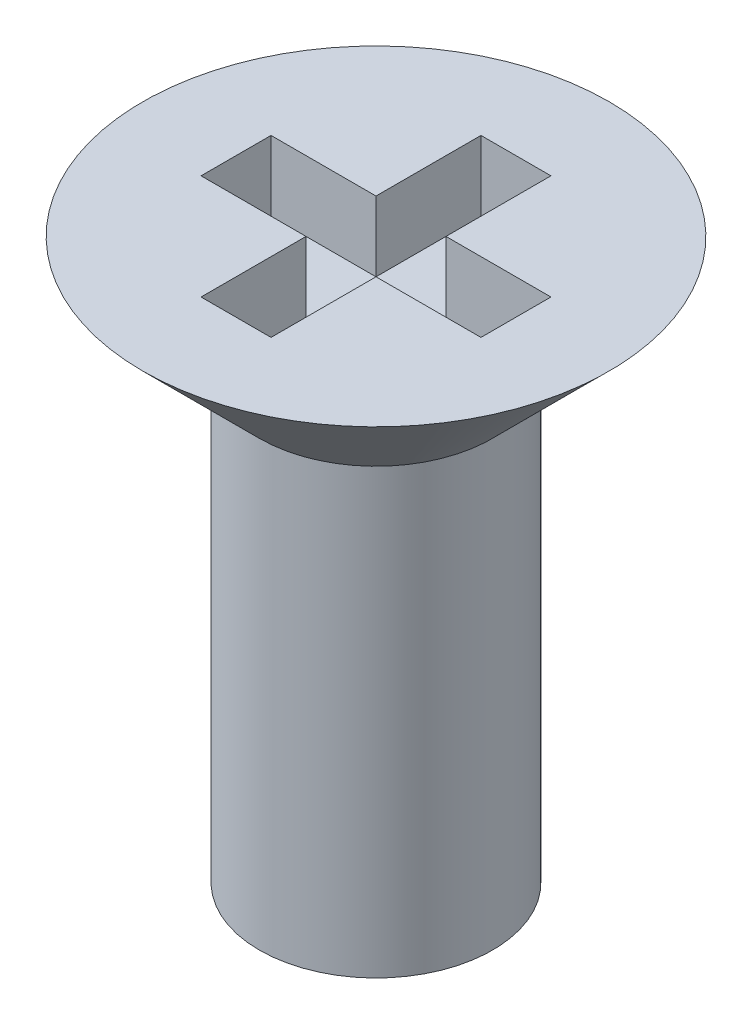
ISO-10303-21;
HEADER;
FILE_DESCRIPTION(('STEP AP214'),'2;1');
FILE_NAME('part.step','',(''),(''),'','','');
FILE_SCHEMA(('AUTOMOTIVE_DESIGN { 1 0 10303 214 1 1 1 1 }'));
ENDSEC;
DATA;
#1=APPLICATION_CONTEXT('core data for automotive mechanical design processes');
#2=APPLICATION_PROTOCOL_DEFINITION('international standard','automotive_design',2000,#1);
#3=PRODUCT_CONTEXT('',#1,'mechanical');
#4=PRODUCT('Part','Part','',(#3));
#5=PRODUCT_RELATED_PRODUCT_CATEGORY('part','',(#4));
#6=PRODUCT_DEFINITION_FORMATION('','',#4);
#7=PRODUCT_DEFINITION_CONTEXT('part definition',#1,'design');
#8=PRODUCT_DEFINITION('design','',#6,#7);
#9=PRODUCT_DEFINITION_SHAPE('','',#8);
#10=(LENGTH_UNIT() NAMED_UNIT(*) SI_UNIT(.MILLI.,.METRE.));
#11=(NAMED_UNIT(*) PLANE_ANGLE_UNIT() SI_UNIT($,.RADIAN.));
#12=(NAMED_UNIT(*) SI_UNIT($,.STERADIAN.) SOLID_ANGLE_UNIT());
#13=UNCERTAINTY_MEASURE_WITH_UNIT(LENGTH_MEASURE(1.E-05),#10,'distance_accuracy_value','');
#14=(GEOMETRIC_REPRESENTATION_CONTEXT(3) GLOBAL_UNCERTAINTY_ASSIGNED_CONTEXT((#13)) GLOBAL_UNIT_ASSIGNED_CONTEXT((#10,
#11,#12)) REPRESENTATION_CONTEXT('',''));
#15=CARTESIAN_POINT('',(0.,0.,0.));
#16=DIRECTION('',(0.,0.,1.));
#17=DIRECTION('',(1.,0.,0.));
#18=AXIS2_PLACEMENT_3D('',#15,#16,#17);
#19=CARTESIAN_POINT('',(4.99999999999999,12.,0.));
#20=DIRECTION('',(0.,-1.,0.));
#21=DIRECTION('',(0.,0.,-1.));
#22=AXIS2_PLACEMENT_3D('',#19,#20,#21);
#23=PLANE('',#22);
#24=CARTESIAN_POINT('',(0.,12.,0.));
#25=DIRECTION('',(0.,1.,0.));
#26=DIRECTION('',(0.,0.,1.));
#27=AXIS2_PLACEMENT_3D('',#24,#25,#26);
#28=CIRCLE('',#27,4.99999999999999);
#29=CARTESIAN_POINT('',(0.,12.,4.99999999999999));
#30=VERTEX_POINT('',#29);
#31=EDGE_CURVE('E228',#30,#30,#28,.T.);
#32=ORIENTED_EDGE('',*,*,#31,.T.);
#33=EDGE_LOOP('',(#32));
#34=FACE_BOUND('',#33,.T.);
#35=DIRECTION('',(-1.,0.,1.49574707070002E-09));
#36=VECTOR('',#35,1.);
#37=CARTESIAN_POINT('',(1.12181035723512E-09,12.,0.750000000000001));
#38=LINE('',#37,#36);
#39=CARTESIAN_POINT('',(-0.750000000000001,12.,0.750000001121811));
#40=VERTEX_POINT('',#39);
#41=CARTESIAN_POINT('',(-2.99999999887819,12.,0.750000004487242));
#42=VERTEX_POINT('',#41);
#43=EDGE_CURVE('E186',#40,#42,#38,.T.);
#44=ORIENTED_EDGE('',*,*,#43,.T.);
#45=DIRECTION('',(1.49574743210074E-09,0.,1.));
#46=VECTOR('',#45,1.);
#47=CARTESIAN_POINT('',(-3.00000000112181,12.,-0.74999999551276));
#48=LINE('',#47,#46);
#49=CARTESIAN_POINT('',(-3.00000000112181,12.,-0.74999999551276));
#50=VERTEX_POINT('',#49);
#51=EDGE_CURVE('E198',#50,#42,#48,.T.);
#52=ORIENTED_EDGE('',*,*,#51,.F.);
#53=DIRECTION('',(1.,0.,-1.49574685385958E-09));
#54=VECTOR('',#53,1.);
#55=CARTESIAN_POINT('',(-3.00000000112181,12.,-0.74999999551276));
#56=LINE('',#55,#54);
#57=CARTESIAN_POINT('',(-0.750000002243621,12.,-0.750000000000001));
#58=VERTEX_POINT('',#57);
#59=EDGE_CURVE('E201',#50,#58,#56,.T.);
#60=ORIENTED_EDGE('',*,*,#59,.T.);
#61=DIRECTION('',(-2.99149421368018E-09,0.,-1.));
#62=VECTOR('',#61,1.);
#63=CARTESIAN_POINT('',(-0.750000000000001,12.,2.24362071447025E-09));
#64=LINE('',#63,#62);
#65=CARTESIAN_POINT('',(-0.750000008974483,12.,-2.99999999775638));
#66=VERTEX_POINT('',#65);
#67=EDGE_CURVE('E164',#58,#66,#64,.T.);
#68=ORIENTED_EDGE('',*,*,#67,.T.);
#69=DIRECTION('',(-1.,0.,2.9914945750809E-09));
#70=VECTOR('',#69,1.);
#71=CARTESIAN_POINT('',(0.749999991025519,12.,-3.00000000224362));
#72=LINE('',#71,#70);
#73=CARTESIAN_POINT('',(0.749999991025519,12.,-3.00000000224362));
#74=VERTEX_POINT('',#73);
#75=EDGE_CURVE('E176',#74,#66,#72,.T.);
#76=ORIENTED_EDGE('',*,*,#75,.F.);
#77=DIRECTION('',(2.99149399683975E-09,0.,1.));
#78=VECTOR('',#77,1.);
#79=CARTESIAN_POINT('',(0.749999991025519,12.,-3.00000000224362));
#80=LINE('',#79,#78);
#81=CARTESIAN_POINT('',(0.750000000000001,12.,-0.750000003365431));
#82=VERTEX_POINT('',#81);
#83=EDGE_CURVE('E168',#74,#82,#80,.T.);
#84=ORIENTED_EDGE('',*,*,#83,.T.);
#85=DIRECTION('',(1.,0.,-4.48724091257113E-09));
#86=VECTOR('',#85,1.);
#87=CARTESIAN_POINT('',(-3.36543073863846E-09,12.,-0.750000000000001));
#88=LINE('',#87,#86);
#89=CARTESIAN_POINT('',(2.99999999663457,12.,-0.750000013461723));
#90=VERTEX_POINT('',#89);
#91=EDGE_CURVE('E160',#82,#90,#88,.T.);
#92=ORIENTED_EDGE('',*,*,#91,.T.);
#93=DIRECTION('',(-4.48724127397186E-09,0.,-1.));
#94=VECTOR('',#93,1.);
#95=CARTESIAN_POINT('',(3.00000000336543,12.,0.749999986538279));
#96=LINE('',#95,#94);
#97=CARTESIAN_POINT('',(3.00000000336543,12.,0.749999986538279));
#98=VERTEX_POINT('',#97);
#99=EDGE_CURVE('E143',#98,#90,#96,.T.);
#100=ORIENTED_EDGE('',*,*,#99,.F.);
#101=CARTESIAN_POINT('',(0.750000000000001,12.,0.74999999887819));
#102=VERTEX_POINT('',#101);
#103=EDGE_CURVE('E196',#98,#102,#38,.T.);
#104=ORIENTED_EDGE('',*,*,#103,.T.);
#105=DIRECTION('',(0.,0.,1.));
#106=VECTOR('',#105,1.);
#107=CARTESIAN_POINT('',(0.750000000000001,12.,0.));
#108=LINE('',#107,#106);
#109=CARTESIAN_POINT('',(0.75,12.,3.));
#110=VERTEX_POINT('',#109);
#111=EDGE_CURVE('E65',#102,#110,#108,.T.);
#112=ORIENTED_EDGE('',*,*,#111,.T.);
#113=DIRECTION('',(1.,0.,0.));
#114=VECTOR('',#113,1.);
#115=CARTESIAN_POINT('',(-0.750000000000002,12.,3.));
#116=LINE('',#115,#114);
#117=CARTESIAN_POINT('',(-0.750000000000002,12.,3.));
#118=VERTEX_POINT('',#117);
#119=EDGE_CURVE('E220',#118,#110,#116,.T.);
#120=ORIENTED_EDGE('',*,*,#119,.F.);
#121=DIRECTION('',(0.,0.,-1.));
#122=VECTOR('',#121,1.);
#123=CARTESIAN_POINT('',(-0.750000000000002,12.,3.));
#124=LINE('',#123,#122);
#125=EDGE_CURVE('E214',#118,#40,#124,.T.);
#126=ORIENTED_EDGE('',*,*,#125,.T.);
#127=EDGE_LOOP('',(#44,#52,#60,#68,#76,#84,#92,#100,#104,#112,#120,#126));
#128=FACE_BOUND('',#127,.T.);
#129=ADVANCED_FACE('F36',(#34,#128),#23,.F.);
#130=CARTESIAN_POINT('',(0.750000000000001,10.5,0.));
#131=DIRECTION('',(-1.,0.,0.));
#132=DIRECTION('',(0.,0.,1.));
#133=AXIS2_PLACEMENT_3D('',#130,#131,#132);
#134=PLANE('',#133);
#135=ORIENTED_EDGE('',*,*,#111,.F.);
#136=DIRECTION('',(0.,-1.,0.));
#137=VECTOR('',#136,1.);
#138=CARTESIAN_POINT('',(0.750000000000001,10.5,0.74999999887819));
#139=LINE('',#138,#137);
#140=CARTESIAN_POINT('',(0.750000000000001,10.5,0.74999999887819));
#141=VERTEX_POINT('',#140);
#142=EDGE_CURVE('E208',#102,#141,#139,.T.);
#143=ORIENTED_EDGE('',*,*,#142,.T.);
#144=DIRECTION('',(0.,0.,1.));
#145=VECTOR('',#144,1.);
#146=CARTESIAN_POINT('',(0.750000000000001,10.5,0.));
#147=LINE('',#146,#145);
#148=CARTESIAN_POINT('',(0.75,10.5,3.));
#149=VERTEX_POINT('',#148);
#150=EDGE_CURVE('E211',#141,#149,#147,.T.);
#151=ORIENTED_EDGE('',*,*,#150,.T.);
#152=DIRECTION('',(0.,1.,0.));
#153=VECTOR('',#152,1.);
#154=CARTESIAN_POINT('',(0.75,10.5,3.));
#155=LINE('',#154,#153);
#156=EDGE_CURVE('E226',#149,#110,#155,.T.);
#157=ORIENTED_EDGE('',*,*,#156,.T.);
#158=EDGE_LOOP('',(#135,#143,#151,#157));
#159=FACE_BOUND('',#158,.T.);
#160=ADVANCED_FACE('F245',(#159),#134,.T.);
#161=CARTESIAN_POINT('',(-0.750000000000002,10.5,3.));
#162=DIRECTION('',(1.,0.,0.));
#163=DIRECTION('',(0.,0.,-1.));
#164=AXIS2_PLACEMENT_3D('',#161,#162,#163);
#165=PLANE('',#164);
#166=DIRECTION('',(0.,0.,-1.));
#167=VECTOR('',#166,1.);
#168=CARTESIAN_POINT('',(-0.750000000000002,10.5,3.));
#169=LINE('',#168,#167);
#170=CARTESIAN_POINT('',(-0.750000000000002,10.5,3.));
#171=VERTEX_POINT('',#170);
#172=CARTESIAN_POINT('',(-0.750000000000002,10.5,0.750000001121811));
#173=VERTEX_POINT('',#172);
#174=EDGE_CURVE('E217',#171,#173,#169,.T.);
#175=ORIENTED_EDGE('',*,*,#174,.T.);
#176=DIRECTION('',(0.,1.,0.));
#177=VECTOR('',#176,1.);
#178=CARTESIAN_POINT('',(-0.750000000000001,10.5,0.750000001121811));
#179=LINE('',#178,#177);
#180=EDGE_CURVE('E73',#173,#40,#179,.T.);
#181=ORIENTED_EDGE('',*,*,#180,.T.);
#182=ORIENTED_EDGE('',*,*,#125,.F.);
#183=DIRECTION('',(0.,1.,0.));
#184=VECTOR('',#183,1.);
#185=CARTESIAN_POINT('',(-0.750000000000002,10.5,3.));
#186=LINE('',#185,#184);
#187=EDGE_CURVE('E53',#171,#118,#186,.T.);
#188=ORIENTED_EDGE('',*,*,#187,.F.);
#189=EDGE_LOOP('',(#175,#181,#182,#188));
#190=FACE_BOUND('',#189,.T.);
#191=ADVANCED_FACE('F241',(#190),#165,.T.);
#192=CARTESIAN_POINT('',(0.,0.,0.));
#193=DIRECTION('',(0.,1.,0.));
#194=DIRECTION('',(0.,0.,1.));
#195=AXIS2_PLACEMENT_3D('',#192,#193,#194);
#196=PLANE('',#195);
#197=CARTESIAN_POINT('',(0.,0.,0.));
#198=DIRECTION('',(0.,1.,0.));
#199=DIRECTION('',(0.,0.,1.));
#200=AXIS2_PLACEMENT_3D('',#197,#198,#199);
#201=CIRCLE('',#200,2.50000000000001);
#202=CARTESIAN_POINT('',(0.,0.,2.50000000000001));
#203=VERTEX_POINT('',#202);
#204=EDGE_CURVE('E11',#203,#203,#201,.T.);
#205=ORIENTED_EDGE('',*,*,#204,.F.);
#206=EDGE_LOOP('',(#205));
#207=FACE_BOUND('',#206,.T.);
#208=ADVANCED_FACE('F38',(#207),#196,.F.);
#209=CARTESIAN_POINT('',(0.,90.8693037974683,0.));
#210=DIRECTION('',(0.,1.,0.));
#211=DIRECTION('',(0.,0.,1.));
#212=AXIS2_PLACEMENT_3D('',#209,#210,#211);
#213=CYLINDRICAL_SURFACE('',#212,2.50000000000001);
#214=CARTESIAN_POINT('',(0.,9.49999999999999,0.));
#215=DIRECTION('',(0.,1.,0.));
#216=DIRECTION('',(0.,0.,1.));
#217=AXIS2_PLACEMENT_3D('',#214,#215,#216);
#218=CIRCLE('',#217,2.50000000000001);
#219=CARTESIAN_POINT('',(0.,9.49999999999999,2.50000000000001));
#220=VERTEX_POINT('',#219);
#221=EDGE_CURVE('E45',#220,#220,#218,.T.);
#222=ORIENTED_EDGE('',*,*,#221,.F.);
#223=EDGE_LOOP('',(#222));
#224=FACE_BOUND('',#223,.T.);
#225=ORIENTED_EDGE('',*,*,#204,.T.);
#226=EDGE_LOOP('',(#225));
#227=FACE_BOUND('',#226,.T.);
#228=ADVANCED_FACE('F235',(#224,#227),#213,.T.);
#229=CARTESIAN_POINT('',(0.,9.49999999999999,0.));
#230=DIRECTION('',(0.,1.,0.));
#231=DIRECTION('',(0.,0.,1.));
#232=AXIS2_PLACEMENT_3D('',#229,#230,#231);
#233=CONICAL_SURFACE('',#232,2.50000000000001,0.785398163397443);
#234=ORIENTED_EDGE('',*,*,#31,.F.);
#235=EDGE_LOOP('',(#234));
#236=FACE_BOUND('',#235,.T.);
#237=ORIENTED_EDGE('',*,*,#221,.T.);
#238=EDGE_LOOP('',(#237));
#239=FACE_BOUND('',#238,.T.);
#240=ADVANCED_FACE('F233',(#236,#239),#233,.T.);
#241=CARTESIAN_POINT('',(-0.750000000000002,10.5,3.));
#242=DIRECTION('',(0.,0.,1.));
#243=DIRECTION('',(1.,0.,0.));
#244=AXIS2_PLACEMENT_3D('',#241,#242,#243);
#245=PLANE('',#244);
#246=ORIENTED_EDGE('',*,*,#119,.T.);
#247=ORIENTED_EDGE('',*,*,#156,.F.);
#248=DIRECTION('',(1.,0.,0.));
#249=VECTOR('',#248,1.);
#250=CARTESIAN_POINT('',(-0.750000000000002,10.5,3.));
#251=LINE('',#250,#249);
#252=EDGE_CURVE('E213',#171,#149,#251,.T.);
#253=ORIENTED_EDGE('',*,*,#252,.F.);
#254=ORIENTED_EDGE('',*,*,#187,.T.);
#255=EDGE_LOOP('',(#246,#247,#253,#254));
#256=FACE_BOUND('',#255,.T.);
#257=ADVANCED_FACE('F258',(#256),#245,.F.);
#258=CARTESIAN_POINT('',(0.750000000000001,10.5,0.));
#259=DIRECTION('',(0.,-1.,0.));
#260=DIRECTION('',(0.,0.,-1.));
#261=AXIS2_PLACEMENT_3D('',#258,#259,#260);
#262=PLANE('',#261);
#263=ORIENTED_EDGE('',*,*,#150,.F.);
#264=DIRECTION('',(-1.,0.,1.49574707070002E-09));
#265=VECTOR('',#264,1.);
#266=CARTESIAN_POINT('',(1.12181035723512E-09,10.5,0.750000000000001));
#267=LINE('',#266,#265);
#268=CARTESIAN_POINT('',(3.00000000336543,10.5,0.749999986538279));
#269=VERTEX_POINT('',#268);
#270=EDGE_CURVE('E155',#269,#141,#267,.T.);
#271=ORIENTED_EDGE('',*,*,#270,.F.);
#272=DIRECTION('',(-4.48724127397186E-09,0.,-1.));
#273=VECTOR('',#272,1.);
#274=CARTESIAN_POINT('',(3.00000000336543,10.5,0.749999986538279));
#275=LINE('',#274,#273);
#276=CARTESIAN_POINT('',(2.99999999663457,10.5,-0.750000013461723));
#277=VERTEX_POINT('',#276);
#278=EDGE_CURVE('E142',#269,#277,#275,.T.);
#279=ORIENTED_EDGE('',*,*,#278,.T.);
#280=DIRECTION('',(1.,0.,-4.48724091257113E-09));
#281=VECTOR('',#280,1.);
#282=CARTESIAN_POINT('',(-3.36543073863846E-09,10.5,-0.750000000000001));
#283=LINE('',#282,#281);
#284=CARTESIAN_POINT('',(0.750000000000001,10.5,-0.750000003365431));
#285=VERTEX_POINT('',#284);
#286=EDGE_CURVE('E131',#285,#277,#283,.T.);
#287=ORIENTED_EDGE('',*,*,#286,.F.);
#288=DIRECTION('',(2.99149399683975E-09,0.,1.));
#289=VECTOR('',#288,1.);
#290=CARTESIAN_POINT('',(0.749999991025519,10.5,-3.00000000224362));
#291=LINE('',#290,#289);
#292=CARTESIAN_POINT('',(0.749999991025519,10.5,-3.00000000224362));
#293=VERTEX_POINT('',#292);
#294=EDGE_CURVE('E171',#293,#285,#291,.T.);
#295=ORIENTED_EDGE('',*,*,#294,.F.);
#296=DIRECTION('',(-1.,0.,2.9914945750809E-09));
#297=VECTOR('',#296,1.);
#298=CARTESIAN_POINT('',(0.749999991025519,10.5,-3.00000000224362));
#299=LINE('',#298,#297);
#300=CARTESIAN_POINT('',(-0.750000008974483,10.5,-2.99999999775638));
#301=VERTEX_POINT('',#300);
#302=EDGE_CURVE('E167',#293,#301,#299,.T.);
#303=ORIENTED_EDGE('',*,*,#302,.T.);
#304=DIRECTION('',(-2.99149421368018E-09,0.,-1.));
#305=VECTOR('',#304,1.);
#306=CARTESIAN_POINT('',(-0.750000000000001,10.5,2.24362071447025E-09));
#307=LINE('',#306,#305);
#308=CARTESIAN_POINT('',(-0.750000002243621,10.5,-0.750000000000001));
#309=VERTEX_POINT('',#308);
#310=EDGE_CURVE('E165',#309,#301,#307,.T.);
#311=ORIENTED_EDGE('',*,*,#310,.F.);
#312=DIRECTION('',(1.,0.,-1.49574685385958E-09));
#313=VECTOR('',#312,1.);
#314=CARTESIAN_POINT('',(-3.00000000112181,10.5,-0.74999999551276));
#315=LINE('',#314,#313);
#316=CARTESIAN_POINT('',(-3.00000000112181,10.5,-0.74999999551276));
#317=VERTEX_POINT('',#316);
#318=EDGE_CURVE('E192',#317,#309,#315,.T.);
#319=ORIENTED_EDGE('',*,*,#318,.F.);
#320=DIRECTION('',(1.49574743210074E-09,0.,1.));
#321=VECTOR('',#320,1.);
#322=CARTESIAN_POINT('',(-3.00000000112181,10.5,-0.74999999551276));
#323=LINE('',#322,#321);
#324=CARTESIAN_POINT('',(-2.99999999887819,10.5,0.750000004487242));
#325=VERTEX_POINT('',#324);
#326=EDGE_CURVE('E188',#317,#325,#323,.T.);
#327=ORIENTED_EDGE('',*,*,#326,.T.);
#328=EDGE_CURVE('E189',#173,#325,#267,.T.);
#329=ORIENTED_EDGE('',*,*,#328,.F.);
#330=ORIENTED_EDGE('',*,*,#174,.F.);
#331=ORIENTED_EDGE('',*,*,#252,.T.);
#332=EDGE_LOOP('',(#263,#271,#279,#287,#295,#303,#311,#319,#327,#329,#330,#331));
#333=FACE_BOUND('',#332,.T.);
#334=ADVANCED_FACE('F154',(#333),#262,.F.);
#335=CARTESIAN_POINT('',(1.12181035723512E-09,10.5,0.750000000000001));
#336=DIRECTION('',(-1.49574707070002E-09,0.,-1.));
#337=DIRECTION('',(-1.,0.,1.49574707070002E-09));
#338=AXIS2_PLACEMENT_3D('',#335,#336,#337);
#339=PLANE('',#338);
#340=ORIENTED_EDGE('',*,*,#103,.F.);
#341=DIRECTION('',(0.,1.,0.));
#342=VECTOR('',#341,1.);
#343=CARTESIAN_POINT('',(3.00000000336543,10.5,0.749999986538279));
#344=LINE('',#343,#342);
#345=EDGE_CURVE('E151',#269,#98,#344,.T.);
#346=ORIENTED_EDGE('',*,*,#345,.F.);
#347=ORIENTED_EDGE('',*,*,#270,.T.);
#348=ORIENTED_EDGE('',*,*,#142,.F.);
#349=EDGE_LOOP('',(#340,#346,#347,#348));
#350=FACE_BOUND('',#349,.T.);
#351=ADVANCED_FACE('F268',(#350),#339,.T.);
#352=CARTESIAN_POINT('',(-3.00000000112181,10.5,-0.74999999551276));
#353=DIRECTION('',(1.49574685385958E-09,0.,1.));
#354=DIRECTION('',(1.,0.,-1.49574685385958E-09));
#355=AXIS2_PLACEMENT_3D('',#352,#353,#354);
#356=PLANE('',#355);
#357=DIRECTION('',(0.,1.,0.));
#358=VECTOR('',#357,1.);
#359=CARTESIAN_POINT('',(-0.750000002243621,10.5,-0.749999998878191));
#360=LINE('',#359,#358);
#361=EDGE_CURVE('E184',#309,#58,#360,.T.);
#362=ORIENTED_EDGE('',*,*,#361,.T.);
#363=ORIENTED_EDGE('',*,*,#59,.F.);
#364=DIRECTION('',(0.,1.,0.));
#365=VECTOR('',#364,1.);
#366=CARTESIAN_POINT('',(-3.00000000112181,10.5,-0.74999999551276));
#367=LINE('',#366,#365);
#368=EDGE_CURVE('E195',#317,#50,#367,.T.);
#369=ORIENTED_EDGE('',*,*,#368,.F.);
#370=ORIENTED_EDGE('',*,*,#318,.T.);
#371=EDGE_LOOP('',(#362,#363,#369,#370));
#372=FACE_BOUND('',#371,.T.);
#373=ADVANCED_FACE('F275',(#372),#356,.T.);
#374=ORIENTED_EDGE('',*,*,#328,.T.);
#375=DIRECTION('',(0.,1.,0.));
#376=VECTOR('',#375,1.);
#377=CARTESIAN_POINT('',(-2.99999999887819,10.5,0.750000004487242));
#378=LINE('',#377,#376);
#379=EDGE_CURVE('E205',#325,#42,#378,.T.);
#380=ORIENTED_EDGE('',*,*,#379,.T.);
#381=ORIENTED_EDGE('',*,*,#43,.F.);
#382=ORIENTED_EDGE('',*,*,#180,.F.);
#383=EDGE_LOOP('',(#374,#380,#381,#382));
#384=FACE_BOUND('',#383,.T.);
#385=ADVANCED_FACE('F271',(#384),#339,.T.);
#386=CARTESIAN_POINT('',(-3.00000000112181,10.5,-0.74999999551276));
#387=DIRECTION('',(-1.,0.,1.49574743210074E-09));
#388=DIRECTION('',(1.49574743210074E-09,0.,1.));
#389=AXIS2_PLACEMENT_3D('',#386,#387,#388);
#390=PLANE('',#389);
#391=ORIENTED_EDGE('',*,*,#51,.T.);
#392=ORIENTED_EDGE('',*,*,#379,.F.);
#393=ORIENTED_EDGE('',*,*,#326,.F.);
#394=ORIENTED_EDGE('',*,*,#368,.T.);
#395=EDGE_LOOP('',(#391,#392,#393,#394));
#396=FACE_BOUND('',#395,.T.);
#397=ADVANCED_FACE('F274',(#396),#390,.F.);
#398=CARTESIAN_POINT('',(-0.750000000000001,10.5,2.24362071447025E-09));
#399=DIRECTION('',(1.,0.,-2.99149421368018E-09));
#400=DIRECTION('',(-2.99149421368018E-09,0.,-1.));
#401=AXIS2_PLACEMENT_3D('',#398,#399,#400);
#402=PLANE('',#401);
#403=ORIENTED_EDGE('',*,*,#310,.T.);
#404=DIRECTION('',(0.,1.,0.));
#405=VECTOR('',#404,1.);
#406=CARTESIAN_POINT('',(-0.750000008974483,10.5,-2.99999999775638));
#407=LINE('',#406,#405);
#408=EDGE_CURVE('E182',#301,#66,#407,.T.);
#409=ORIENTED_EDGE('',*,*,#408,.T.);
#410=ORIENTED_EDGE('',*,*,#67,.F.);
#411=ORIENTED_EDGE('',*,*,#361,.F.);
#412=EDGE_LOOP('',(#403,#409,#410,#411));
#413=FACE_BOUND('',#412,.T.);
#414=ADVANCED_FACE('F278',(#413),#402,.T.);
#415=CARTESIAN_POINT('',(0.749999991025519,10.5,-3.00000000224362));
#416=DIRECTION('',(-1.,0.,2.99149399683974E-09));
#417=DIRECTION('',(2.99149399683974E-09,0.,1.));
#418=AXIS2_PLACEMENT_3D('',#415,#416,#417);
#419=PLANE('',#418);
#420=DIRECTION('',(0.,1.,0.));
#421=VECTOR('',#420,1.);
#422=CARTESIAN_POINT('',(0.74999999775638,10.5,-0.750000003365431));
#423=LINE('',#422,#421);
#424=EDGE_CURVE('E137',#285,#82,#423,.T.);
#425=ORIENTED_EDGE('',*,*,#424,.T.);
#426=ORIENTED_EDGE('',*,*,#83,.F.);
#427=DIRECTION('',(0.,1.,0.));
#428=VECTOR('',#427,1.);
#429=CARTESIAN_POINT('',(0.749999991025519,10.5,-3.00000000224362));
#430=LINE('',#429,#428);
#431=EDGE_CURVE('E173',#293,#74,#430,.T.);
#432=ORIENTED_EDGE('',*,*,#431,.F.);
#433=ORIENTED_EDGE('',*,*,#294,.T.);
#434=EDGE_LOOP('',(#425,#426,#432,#433));
#435=FACE_BOUND('',#434,.T.);
#436=ADVANCED_FACE('F285',(#435),#419,.T.);
#437=CARTESIAN_POINT('',(0.749999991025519,10.5,-3.00000000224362));
#438=DIRECTION('',(-2.9914945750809E-09,0.,-1.));
#439=DIRECTION('',(-1.,0.,2.9914945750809E-09));
#440=AXIS2_PLACEMENT_3D('',#437,#438,#439);
#441=PLANE('',#440);
#442=ORIENTED_EDGE('',*,*,#75,.T.);
#443=ORIENTED_EDGE('',*,*,#408,.F.);
#444=ORIENTED_EDGE('',*,*,#302,.F.);
#445=ORIENTED_EDGE('',*,*,#431,.T.);
#446=EDGE_LOOP('',(#442,#443,#444,#445));
#447=FACE_BOUND('',#446,.T.);
#448=ADVANCED_FACE('F287',(#447),#441,.F.);
#449=CARTESIAN_POINT('',(-3.36543073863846E-09,10.5,-0.750000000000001));
#450=DIRECTION('',(4.48724091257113E-09,0.,1.));
#451=DIRECTION('',(1.,0.,-4.48724091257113E-09));
#452=AXIS2_PLACEMENT_3D('',#449,#450,#451);
#453=PLANE('',#452);
#454=ORIENTED_EDGE('',*,*,#286,.T.);
#455=DIRECTION('',(0.,1.,0.));
#456=VECTOR('',#455,1.);
#457=CARTESIAN_POINT('',(2.99999999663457,10.5,-0.750000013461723));
#458=LINE('',#457,#456);
#459=EDGE_CURVE('E135',#277,#90,#458,.T.);
#460=ORIENTED_EDGE('',*,*,#459,.T.);
#461=ORIENTED_EDGE('',*,*,#91,.F.);
#462=ORIENTED_EDGE('',*,*,#424,.F.);
#463=EDGE_LOOP('',(#454,#460,#461,#462));
#464=FACE_BOUND('',#463,.T.);
#465=ADVANCED_FACE('F133',(#464),#453,.T.);
#466=CARTESIAN_POINT('',(3.00000000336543,10.5,0.749999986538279));
#467=DIRECTION('',(1.,0.,-4.48724127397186E-09));
#468=DIRECTION('',(-4.48724127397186E-09,0.,-1.));
#469=AXIS2_PLACEMENT_3D('',#466,#467,#468);
#470=PLANE('',#469);
#471=ORIENTED_EDGE('',*,*,#99,.T.);
#472=ORIENTED_EDGE('',*,*,#459,.F.);
#473=ORIENTED_EDGE('',*,*,#278,.F.);
#474=ORIENTED_EDGE('',*,*,#345,.T.);
#475=EDGE_LOOP('',(#471,#472,#473,#474));
#476=FACE_BOUND('',#475,.T.);
#477=ADVANCED_FACE('F147',(#476),#470,.F.);
#478=CLOSED_SHELL('',(#129,#160,#191,#208,#228,#240,#257,#334,#351,#373,#385,#397,#414,#436,
#448,#465,#477));
#479=MANIFOLD_SOLID_BREP('B2',#478);
#480=ADVANCED_BREP_SHAPE_REPRESENTATION('',(#18,#479),#14);
#481=SHAPE_DEFINITION_REPRESENTATION(#9,#480);
ENDSEC;
END-ISO-10303-21;
